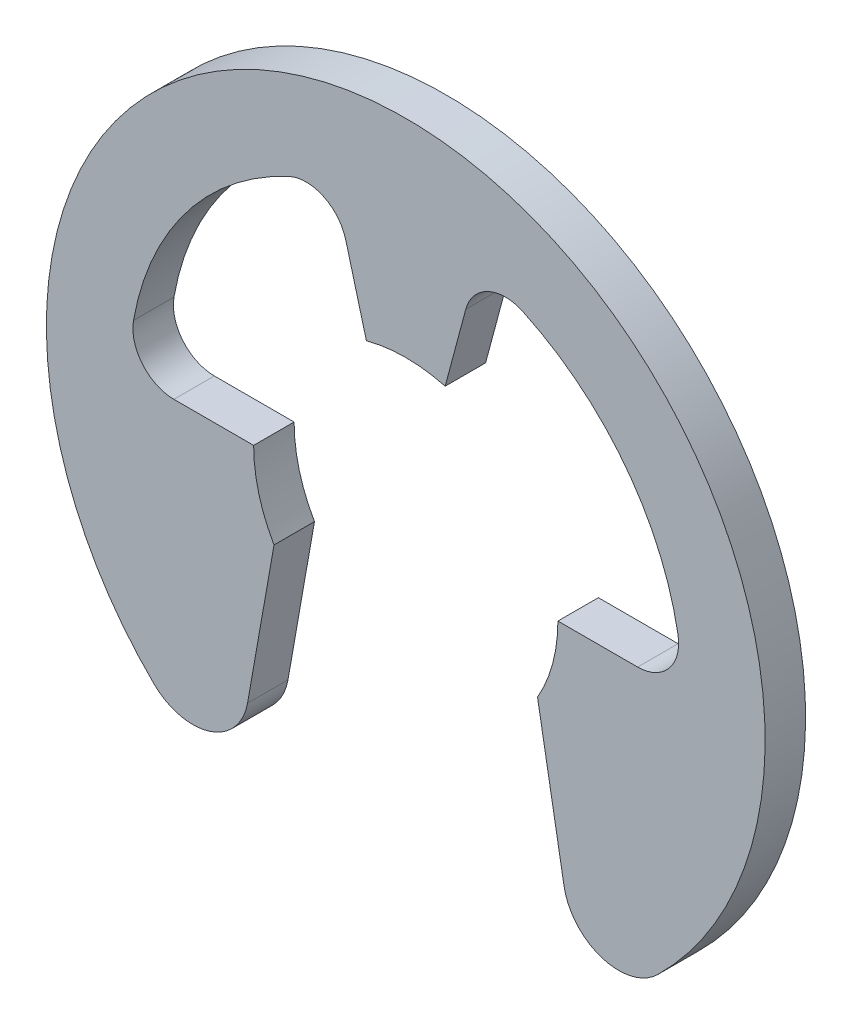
ISO-10303-21;
HEADER;
FILE_DESCRIPTION(('STEP AP214'),'2;1');
FILE_NAME('part.step','',(''),(''),'','','');
FILE_SCHEMA(('AUTOMOTIVE_DESIGN { 1 0 10303 214 1 1 1 1 }'));
ENDSEC;
DATA;
#1=APPLICATION_CONTEXT('core data for automotive mechanical design processes');
#2=APPLICATION_PROTOCOL_DEFINITION('international standard','automotive_design',2000,#1);
#3=PRODUCT_CONTEXT('',#1,'mechanical');
#4=PRODUCT('Part','Part','',(#3));
#5=PRODUCT_RELATED_PRODUCT_CATEGORY('part','',(#4));
#6=PRODUCT_DEFINITION_FORMATION('','',#4);
#7=PRODUCT_DEFINITION_CONTEXT('part definition',#1,'design');
#8=PRODUCT_DEFINITION('design','',#6,#7);
#9=PRODUCT_DEFINITION_SHAPE('','',#8);
#10=(LENGTH_UNIT() NAMED_UNIT(*) SI_UNIT(.MILLI.,.METRE.));
#11=(NAMED_UNIT(*) PLANE_ANGLE_UNIT() SI_UNIT($,.RADIAN.));
#12=(NAMED_UNIT(*) SI_UNIT($,.STERADIAN.) SOLID_ANGLE_UNIT());
#13=UNCERTAINTY_MEASURE_WITH_UNIT(LENGTH_MEASURE(1.E-05),#10,'distance_accuracy_value','');
#14=(GEOMETRIC_REPRESENTATION_CONTEXT(3) GLOBAL_UNCERTAINTY_ASSIGNED_CONTEXT((#13)) GLOBAL_UNIT_ASSIGNED_CONTEXT((#10,
#11,#12)) REPRESENTATION_CONTEXT('',''));
#15=CARTESIAN_POINT('',(0.,0.,0.));
#16=DIRECTION('',(0.,0.,1.));
#17=DIRECTION('',(1.,0.,0.));
#18=AXIS2_PLACEMENT_3D('',#15,#16,#17);
#19=CARTESIAN_POINT('',(3.63847823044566,0.643955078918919,-0.635));
#20=DIRECTION('',(0.,0.,1.));
#21=DIRECTION('',(1.,0.,0.));
#22=AXIS2_PLACEMENT_3D('',#19,#20,#21);
#23=CYLINDRICAL_SURFACE('',#22,0.643955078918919);
#24=CARTESIAN_POINT('',(3.63847823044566,0.643955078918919,0.));
#25=DIRECTION('',(0.,0.,-1.));
#26=DIRECTION('',(1.,0.,0.));
#27=AXIS2_PLACEMENT_3D('',#24,#25,#26);
#28=CIRCLE('',#27,0.643955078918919);
#29=CARTESIAN_POINT('',(4.27257873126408,0.756181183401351,0.));
#30=VERTEX_POINT('',#29);
#31=CARTESIAN_POINT('',(3.63847823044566,0.,0.));
#32=VERTEX_POINT('',#31);
#33=EDGE_CURVE('E190',#30,#32,#28,.T.);
#34=ORIENTED_EDGE('',*,*,#33,.F.);
#35=DIRECTION('',(0.,0.,1.));
#36=VECTOR('',#35,1.);
#37=CARTESIAN_POINT('',(4.27257873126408,0.756181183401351,-0.635));
#38=LINE('',#37,#36);
#39=CARTESIAN_POINT('',(4.27257873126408,0.756181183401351,-0.635));
#40=VERTEX_POINT('',#39);
#41=EDGE_CURVE('E11',#40,#30,#38,.T.);
#42=ORIENTED_EDGE('',*,*,#41,.F.);
#43=CARTESIAN_POINT('',(3.63847823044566,0.643955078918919,-0.635));
#44=DIRECTION('',(0.,0.,-1.));
#45=DIRECTION('',(1.,0.,0.));
#46=AXIS2_PLACEMENT_3D('',#43,#44,#45);
#47=CIRCLE('',#46,0.643955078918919);
#48=CARTESIAN_POINT('',(3.63847823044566,0.,-0.635));
#49=VERTEX_POINT('',#48);
#50=EDGE_CURVE('E240',#40,#49,#47,.T.);
#51=ORIENTED_EDGE('',*,*,#50,.T.);
#52=DIRECTION('',(0.,0.,1.));
#53=VECTOR('',#52,1.);
#54=CARTESIAN_POINT('',(3.63847823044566,0.,-0.635));
#55=LINE('',#54,#53);
#56=EDGE_CURVE('E36',#49,#32,#55,.T.);
#57=ORIENTED_EDGE('',*,*,#56,.T.);
#58=EDGE_LOOP('',(#34,#42,#51,#57));
#59=FACE_BOUND('',#58,.T.);
#60=ADVANCED_FACE('F33',(#59),#23,.F.);
#61=CARTESIAN_POINT('',(0.,0.,-0.635));
#62=DIRECTION('',(0.,0.,1.));
#63=DIRECTION('',(1.,0.,0.));
#64=AXIS2_PLACEMENT_3D('',#61,#62,#63);
#65=CYLINDRICAL_SURFACE('',#64,4.33897902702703);
#66=CARTESIAN_POINT('',(0.,0.,0.));
#67=DIRECTION('',(0.,0.,-1.));
#68=DIRECTION('',(1.,0.,0.));
#69=AXIS2_PLACEMENT_3D('',#66,#67,#68);
#70=CIRCLE('',#69,4.33897902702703);
#71=CARTESIAN_POINT('',(1.83623968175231,3.93128004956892,0.));
#72=VERTEX_POINT('',#71);
#73=EDGE_CURVE('E238',#72,#30,#70,.T.);
#74=ORIENTED_EDGE('',*,*,#73,.F.);
#75=DIRECTION('',(0.,0.,1.));
#76=VECTOR('',#75,1.);
#77=CARTESIAN_POINT('',(1.83623968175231,3.93128004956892,-0.635));
#78=LINE('',#77,#76);
#79=CARTESIAN_POINT('',(1.83623968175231,3.93128004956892,-0.635));
#80=VERTEX_POINT('',#79);
#81=EDGE_CURVE('E42',#80,#72,#78,.T.);
#82=ORIENTED_EDGE('',*,*,#81,.F.);
#83=CARTESIAN_POINT('',(0.,0.,-0.635));
#84=DIRECTION('',(0.,0.,-1.));
#85=DIRECTION('',(1.,0.,0.));
#86=AXIS2_PLACEMENT_3D('',#83,#84,#85);
#87=CIRCLE('',#86,4.33897902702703);
#88=EDGE_CURVE('E180',#80,#40,#87,.T.);
#89=ORIENTED_EDGE('',*,*,#88,.T.);
#90=ORIENTED_EDGE('',*,*,#41,.T.);
#91=EDGE_LOOP('',(#74,#82,#89,#90));
#92=FACE_BOUND('',#91,.T.);
#93=ADVANCED_FACE('F272',(#92),#65,.F.);
#94=CARTESIAN_POINT('',(1.56372030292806,3.34783225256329,-0.635));
#95=DIRECTION('',(0.,0.,1.));
#96=DIRECTION('',(1.,0.,0.));
#97=AXIS2_PLACEMENT_3D('',#94,#95,#96);
#98=CYLINDRICAL_SURFACE('',#97,0.643955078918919);
#99=CARTESIAN_POINT('',(1.56372030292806,3.34783225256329,0.));
#100=DIRECTION('',(0.,0.,-1.));
#101=DIRECTION('',(1.,0.,0.));
#102=AXIS2_PLACEMENT_3D('',#99,#100,#101);
#103=CIRCLE('',#102,0.643955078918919);
#104=CARTESIAN_POINT('',(0.941707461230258,3.51450009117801,0.));
#105=VERTEX_POINT('',#104);
#106=EDGE_CURVE('E167',#105,#72,#103,.T.);
#107=ORIENTED_EDGE('',*,*,#106,.F.);
#108=DIRECTION('',(0.,0.,1.));
#109=VECTOR('',#108,1.);
#110=CARTESIAN_POINT('',(0.941707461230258,3.51450009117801,-0.635));
#111=LINE('',#110,#109);
#112=CARTESIAN_POINT('',(0.941707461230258,3.51450009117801,-0.635));
#113=VERTEX_POINT('',#112);
#114=EDGE_CURVE('E162',#113,#105,#111,.T.);
#115=ORIENTED_EDGE('',*,*,#114,.F.);
#116=CARTESIAN_POINT('',(1.56372030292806,3.34783225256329,-0.635));
#117=DIRECTION('',(0.,0.,-1.));
#118=DIRECTION('',(1.,0.,0.));
#119=AXIS2_PLACEMENT_3D('',#116,#117,#118);
#120=CIRCLE('',#119,0.643955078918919);
#121=EDGE_CURVE('E165',#113,#80,#120,.T.);
#122=ORIENTED_EDGE('',*,*,#121,.T.);
#123=ORIENTED_EDGE('',*,*,#81,.T.);
#124=EDGE_LOOP('',(#107,#115,#122,#123));
#125=FACE_BOUND('',#124,.T.);
#126=ADVANCED_FACE('F164',(#125),#98,.F.);
#127=CARTESIAN_POINT('',(0.617956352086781,2.30624450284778,-0.635));
#128=DIRECTION('',(0.965925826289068,-0.258819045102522,0.));
#129=DIRECTION('',(0.258819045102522,0.965925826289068,0.));
#130=AXIS2_PLACEMENT_3D('',#127,#128,#129);
#131=PLANE('',#130);
#132=DIRECTION('',(0.258819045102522,0.965925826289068,0.));
#133=VECTOR('',#132,1.);
#134=CARTESIAN_POINT('',(0.617956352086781,2.30624450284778,0.));
#135=LINE('',#134,#133);
#136=CARTESIAN_POINT('',(0.617956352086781,2.30624450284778,0.));
#137=VERTEX_POINT('',#136);
#138=EDGE_CURVE('E235',#137,#105,#135,.T.);
#139=ORIENTED_EDGE('',*,*,#138,.F.);
#140=DIRECTION('',(0.,0.,1.));
#141=VECTOR('',#140,1.);
#142=CARTESIAN_POINT('',(0.617956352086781,2.30624450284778,-0.635));
#143=LINE('',#142,#141);
#144=CARTESIAN_POINT('',(0.617956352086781,2.30624450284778,-0.635));
#145=VERTEX_POINT('',#144);
#146=EDGE_CURVE('E172',#145,#137,#143,.T.);
#147=ORIENTED_EDGE('',*,*,#146,.F.);
#148=DIRECTION('',(0.258819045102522,0.965925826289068,0.));
#149=VECTOR('',#148,1.);
#150=CARTESIAN_POINT('',(0.617956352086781,2.30624450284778,-0.635));
#151=LINE('',#150,#149);
#152=EDGE_CURVE('E178',#145,#113,#151,.T.);
#153=ORIENTED_EDGE('',*,*,#152,.T.);
#154=ORIENTED_EDGE('',*,*,#114,.T.);
#155=EDGE_LOOP('',(#139,#147,#153,#154));
#156=FACE_BOUND('',#155,.T.);
#157=ADVANCED_FACE('F182',(#156),#131,.T.);
#158=CARTESIAN_POINT('',(0.,0.,-0.635));
#159=DIRECTION('',(0.,0.,1.));
#160=DIRECTION('',(1.,0.,0.));
#161=AXIS2_PLACEMENT_3D('',#158,#159,#160);
#162=CYLINDRICAL_SURFACE('',#161,2.3876);
#163=CARTESIAN_POINT('',(0.,0.,0.));
#164=DIRECTION('',(0.,0.,-1.));
#165=DIRECTION('',(-1.,0.,0.));
#166=AXIS2_PLACEMENT_3D('',#163,#164,#165);
#167=CIRCLE('',#166,2.3876);
#168=CARTESIAN_POINT('',(-0.61795635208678,2.30624450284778,0.));
#169=VERTEX_POINT('',#168);
#170=EDGE_CURVE('E232',#169,#137,#167,.T.);
#171=ORIENTED_EDGE('',*,*,#170,.F.);
#172=DIRECTION('',(0.,0.,1.));
#173=VECTOR('',#172,1.);
#174=CARTESIAN_POINT('',(-0.61795635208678,2.30624450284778,-0.635));
#175=LINE('',#174,#173);
#176=CARTESIAN_POINT('',(-0.61795635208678,2.30624450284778,-0.635));
#177=VERTEX_POINT('',#176);
#178=EDGE_CURVE('E244',#177,#169,#175,.T.);
#179=ORIENTED_EDGE('',*,*,#178,.F.);
#180=CARTESIAN_POINT('',(0.,0.,-0.635));
#181=DIRECTION('',(0.,0.,-1.));
#182=DIRECTION('',(-1.,0.,0.));
#183=AXIS2_PLACEMENT_3D('',#180,#181,#182);
#184=CIRCLE('',#183,2.3876);
#185=EDGE_CURVE('E183',#177,#145,#184,.T.);
#186=ORIENTED_EDGE('',*,*,#185,.T.);
#187=ORIENTED_EDGE('',*,*,#146,.T.);
#188=EDGE_LOOP('',(#171,#179,#186,#187));
#189=FACE_BOUND('',#188,.T.);
#190=ADVANCED_FACE('F285',(#189),#162,.F.);
#191=CARTESIAN_POINT('',(-0.617956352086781,2.30624450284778,-0.635));
#192=DIRECTION('',(-0.965925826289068,-0.258819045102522,0.));
#193=DIRECTION('',(0.258819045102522,-0.965925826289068,0.));
#194=AXIS2_PLACEMENT_3D('',#191,#192,#193);
#195=PLANE('',#194);
#196=DIRECTION('',(0.258819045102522,-0.965925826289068,0.));
#197=VECTOR('',#196,1.);
#198=CARTESIAN_POINT('',(-0.617956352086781,2.30624450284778,0.));
#199=LINE('',#198,#197);
#200=CARTESIAN_POINT('',(-0.941707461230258,3.51450009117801,0.));
#201=VERTEX_POINT('',#200);
#202=EDGE_CURVE('E229',#201,#169,#199,.T.);
#203=ORIENTED_EDGE('',*,*,#202,.F.);
#204=DIRECTION('',(0.,0.,1.));
#205=VECTOR('',#204,1.);
#206=CARTESIAN_POINT('',(-0.941707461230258,3.51450009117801,-0.635));
#207=LINE('',#206,#205);
#208=CARTESIAN_POINT('',(-0.941707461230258,3.51450009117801,-0.635));
#209=VERTEX_POINT('',#208);
#210=EDGE_CURVE('E246',#209,#201,#207,.T.);
#211=ORIENTED_EDGE('',*,*,#210,.F.);
#212=DIRECTION('',(0.258819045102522,-0.965925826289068,0.));
#213=VECTOR('',#212,1.);
#214=CARTESIAN_POINT('',(-0.617956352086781,2.30624450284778,-0.635));
#215=LINE('',#214,#213);
#216=EDGE_CURVE('E185',#209,#177,#215,.T.);
#217=ORIENTED_EDGE('',*,*,#216,.T.);
#218=ORIENTED_EDGE('',*,*,#178,.T.);
#219=EDGE_LOOP('',(#203,#211,#217,#218));
#220=FACE_BOUND('',#219,.T.);
#221=ADVANCED_FACE('F288',(#220),#195,.T.);
#222=CARTESIAN_POINT('',(-1.56372030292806,3.34783225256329,-0.635));
#223=DIRECTION('',(0.,0.,1.));
#224=DIRECTION('',(1.,0.,0.));
#225=AXIS2_PLACEMENT_3D('',#222,#223,#224);
#226=CYLINDRICAL_SURFACE('',#225,0.643955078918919);
#227=CARTESIAN_POINT('',(-1.56372030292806,3.34783225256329,0.));
#228=DIRECTION('',(0.,0.,-1.));
#229=DIRECTION('',(1.,0.,0.));
#230=AXIS2_PLACEMENT_3D('',#227,#228,#229);
#231=CIRCLE('',#230,0.643955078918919);
#232=CARTESIAN_POINT('',(-1.83623968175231,3.93128004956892,0.));
#233=VERTEX_POINT('',#232);
#234=EDGE_CURVE('E226',#233,#201,#231,.T.);
#235=ORIENTED_EDGE('',*,*,#234,.F.);
#236=DIRECTION('',(0.,0.,1.));
#237=VECTOR('',#236,1.);
#238=CARTESIAN_POINT('',(-1.83623968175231,3.93128004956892,-0.635));
#239=LINE('',#238,#237);
#240=CARTESIAN_POINT('',(-1.83623968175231,3.93128004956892,-0.635));
#241=VERTEX_POINT('',#240);
#242=EDGE_CURVE('E248',#241,#233,#239,.T.);
#243=ORIENTED_EDGE('',*,*,#242,.F.);
#244=CARTESIAN_POINT('',(-1.56372030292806,3.34783225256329,-0.635));
#245=DIRECTION('',(0.,0.,-1.));
#246=DIRECTION('',(1.,0.,0.));
#247=AXIS2_PLACEMENT_3D('',#244,#245,#246);
#248=CIRCLE('',#247,0.643955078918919);
#249=EDGE_CURVE('E496',#241,#209,#248,.T.);
#250=ORIENTED_EDGE('',*,*,#249,.T.);
#251=ORIENTED_EDGE('',*,*,#210,.T.);
#252=EDGE_LOOP('',(#235,#243,#250,#251));
#253=FACE_BOUND('',#252,.T.);
#254=ADVANCED_FACE('F292',(#253),#226,.F.);
#255=CARTESIAN_POINT('',(0.,0.,-0.635));
#256=DIRECTION('',(0.,0.,1.));
#257=DIRECTION('',(1.,0.,0.));
#258=AXIS2_PLACEMENT_3D('',#255,#256,#257);
#259=CYLINDRICAL_SURFACE('',#258,4.33897902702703);
#260=CARTESIAN_POINT('',(0.,0.,0.));
#261=DIRECTION('',(0.,0.,-1.));
#262=DIRECTION('',(1.,0.,0.));
#263=AXIS2_PLACEMENT_3D('',#260,#261,#262);
#264=CIRCLE('',#263,4.33897902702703);
#265=CARTESIAN_POINT('',(-4.27257873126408,0.756181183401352,0.));
#266=VERTEX_POINT('',#265);
#267=EDGE_CURVE('E223',#266,#233,#264,.T.);
#268=ORIENTED_EDGE('',*,*,#267,.F.);
#269=DIRECTION('',(0.,0.,1.));
#270=VECTOR('',#269,1.);
#271=CARTESIAN_POINT('',(-4.27257873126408,0.756181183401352,-0.635));
#272=LINE('',#271,#270);
#273=CARTESIAN_POINT('',(-4.27257873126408,0.756181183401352,-0.635));
#274=VERTEX_POINT('',#273);
#275=EDGE_CURVE('E250',#274,#266,#272,.T.);
#276=ORIENTED_EDGE('',*,*,#275,.F.);
#277=CARTESIAN_POINT('',(0.,0.,-0.635));
#278=DIRECTION('',(0.,0.,-1.));
#279=DIRECTION('',(1.,0.,0.));
#280=AXIS2_PLACEMENT_3D('',#277,#278,#279);
#281=CIRCLE('',#280,4.33897902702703);
#282=EDGE_CURVE('E500',#274,#241,#281,.T.);
#283=ORIENTED_EDGE('',*,*,#282,.T.);
#284=ORIENTED_EDGE('',*,*,#242,.T.);
#285=EDGE_LOOP('',(#268,#276,#283,#284));
#286=FACE_BOUND('',#285,.T.);
#287=ADVANCED_FACE('F296',(#286),#259,.F.);
#288=CARTESIAN_POINT('',(-3.63847823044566,0.643955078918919,-0.635));
#289=DIRECTION('',(0.,0.,1.));
#290=DIRECTION('',(1.,0.,0.));
#291=AXIS2_PLACEMENT_3D('',#288,#289,#290);
#292=CYLINDRICAL_SURFACE('',#291,0.643955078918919);
#293=CARTESIAN_POINT('',(-3.63847823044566,0.643955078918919,0.));
#294=DIRECTION('',(0.,0.,-1.));
#295=DIRECTION('',(1.,0.,0.));
#296=AXIS2_PLACEMENT_3D('',#293,#294,#295);
#297=CIRCLE('',#296,0.643955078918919);
#298=CARTESIAN_POINT('',(-3.63847823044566,0.,0.));
#299=VERTEX_POINT('',#298);
#300=EDGE_CURVE('E220',#299,#266,#297,.T.);
#301=ORIENTED_EDGE('',*,*,#300,.F.);
#302=DIRECTION('',(0.,0.,1.));
#303=VECTOR('',#302,1.);
#304=CARTESIAN_POINT('',(-3.63847823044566,0.,-0.635));
#305=LINE('',#304,#303);
#306=CARTESIAN_POINT('',(-3.63847823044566,0.,-0.635));
#307=VERTEX_POINT('',#306);
#308=EDGE_CURVE('E252',#307,#299,#305,.T.);
#309=ORIENTED_EDGE('',*,*,#308,.F.);
#310=CARTESIAN_POINT('',(-3.63847823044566,0.643955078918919,-0.635));
#311=DIRECTION('',(0.,0.,-1.));
#312=DIRECTION('',(1.,0.,0.));
#313=AXIS2_PLACEMENT_3D('',#310,#311,#312);
#314=CIRCLE('',#313,0.643955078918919);
#315=EDGE_CURVE('E489',#307,#274,#314,.T.);
#316=ORIENTED_EDGE('',*,*,#315,.T.);
#317=ORIENTED_EDGE('',*,*,#275,.T.);
#318=EDGE_LOOP('',(#301,#309,#316,#317));
#319=FACE_BOUND('',#318,.T.);
#320=ADVANCED_FACE('F300',(#319),#292,.F.);
#321=CARTESIAN_POINT('',(-2.3876,0.,-0.635));
#322=DIRECTION('',(0.,1.,0.));
#323=DIRECTION('',(-1.,0.,0.));
#324=AXIS2_PLACEMENT_3D('',#321,#322,#323);
#325=PLANE('',#324);
#326=DIRECTION('',(-1.,0.,0.));
#327=VECTOR('',#326,1.);
#328=CARTESIAN_POINT('',(-2.3876,0.,0.));
#329=LINE('',#328,#327);
#330=CARTESIAN_POINT('',(-2.3876,0.,0.));
#331=VERTEX_POINT('',#330);
#332=EDGE_CURVE('E217',#331,#299,#329,.T.);
#333=ORIENTED_EDGE('',*,*,#332,.F.);
#334=DIRECTION('',(0.,0.,1.));
#335=VECTOR('',#334,1.);
#336=CARTESIAN_POINT('',(-2.3876,0.,-0.635));
#337=LINE('',#336,#335);
#338=CARTESIAN_POINT('',(-2.3876,0.,-0.635));
#339=VERTEX_POINT('',#338);
#340=EDGE_CURVE('E254',#339,#331,#337,.T.);
#341=ORIENTED_EDGE('',*,*,#340,.F.);
#342=DIRECTION('',(-1.,0.,0.));
#343=VECTOR('',#342,1.);
#344=CARTESIAN_POINT('',(-2.3876,0.,-0.635));
#345=LINE('',#344,#343);
#346=EDGE_CURVE('E485',#339,#307,#345,.T.);
#347=ORIENTED_EDGE('',*,*,#346,.T.);
#348=ORIENTED_EDGE('',*,*,#308,.T.);
#349=EDGE_LOOP('',(#333,#341,#347,#348));
#350=FACE_BOUND('',#349,.T.);
#351=ADVANCED_FACE('F304',(#350),#325,.T.);
#352=CARTESIAN_POINT('',(0.,0.,-0.635));
#353=DIRECTION('',(0.,0.,1.));
#354=DIRECTION('',(1.,0.,0.));
#355=AXIS2_PLACEMENT_3D('',#352,#353,#354);
#356=CYLINDRICAL_SURFACE('',#355,2.3876);
#357=CARTESIAN_POINT('',(0.,0.,0.));
#358=DIRECTION('',(0.,0.,-1.));
#359=DIRECTION('',(1.,0.,0.));
#360=AXIS2_PLACEMENT_3D('',#357,#358,#359);
#361=CIRCLE('',#360,2.3876);
#362=CARTESIAN_POINT('',(-2.06772225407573,-1.1938,0.));
#363=VERTEX_POINT('',#362);
#364=EDGE_CURVE('E214',#363,#331,#361,.T.);
#365=ORIENTED_EDGE('',*,*,#364,.F.);
#366=DIRECTION('',(0.,0.,1.));
#367=VECTOR('',#366,1.);
#368=CARTESIAN_POINT('',(-2.06772225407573,-1.1938,-0.635));
#369=LINE('',#368,#367);
#370=CARTESIAN_POINT('',(-2.06772225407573,-1.1938,-0.635));
#371=VERTEX_POINT('',#370);
#372=EDGE_CURVE('E256',#371,#363,#369,.T.);
#373=ORIENTED_EDGE('',*,*,#372,.F.);
#374=CARTESIAN_POINT('',(0.,0.,-0.635));
#375=DIRECTION('',(0.,0.,-1.));
#376=DIRECTION('',(1.,0.,0.));
#377=AXIS2_PLACEMENT_3D('',#374,#375,#376);
#378=CIRCLE('',#377,2.3876);
#379=EDGE_CURVE('E506',#371,#339,#378,.T.);
#380=ORIENTED_EDGE('',*,*,#379,.T.);
#381=ORIENTED_EDGE('',*,*,#340,.T.);
#382=EDGE_LOOP('',(#365,#373,#380,#381));
#383=FACE_BOUND('',#382,.T.);
#384=ADVANCED_FACE('F308',(#383),#356,.F.);
#385=CARTESIAN_POINT('',(-2.06772225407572,-1.1938,-0.635));
#386=DIRECTION('',(0.984807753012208,-0.17364817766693,0.));
#387=DIRECTION('',(0.17364817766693,0.984807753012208,0.));
#388=AXIS2_PLACEMENT_3D('',#385,#386,#387);
#389=PLANE('',#388);
#390=DIRECTION('',(0.17364817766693,0.984807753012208,0.));
#391=VECTOR('',#390,1.);
#392=CARTESIAN_POINT('',(-2.06772225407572,-1.1938,0.));
#393=LINE('',#392,#391);
#394=CARTESIAN_POINT('',(-2.48361962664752,-3.55247120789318,0.));
#395=VERTEX_POINT('',#394);
#396=EDGE_CURVE('E211',#395,#363,#393,.T.);
#397=ORIENTED_EDGE('',*,*,#396,.F.);
#398=DIRECTION('',(0.,0.,1.));
#399=VECTOR('',#398,1.);
#400=CARTESIAN_POINT('',(-2.48361962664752,-3.55247120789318,-0.635));
#401=LINE('',#400,#399);
#402=CARTESIAN_POINT('',(-2.48361962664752,-3.55247120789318,-0.635));
#403=VERTEX_POINT('',#402);
#404=EDGE_CURVE('E258',#403,#395,#401,.T.);
#405=ORIENTED_EDGE('',*,*,#404,.F.);
#406=DIRECTION('',(0.17364817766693,0.984807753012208,0.));
#407=VECTOR('',#406,1.);
#408=CARTESIAN_POINT('',(-2.06772225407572,-1.1938,-0.635));
#409=LINE('',#408,#407);
#410=EDGE_CURVE('E478',#403,#371,#409,.T.);
#411=ORIENTED_EDGE('',*,*,#410,.T.);
#412=ORIENTED_EDGE('',*,*,#372,.T.);
#413=EDGE_LOOP('',(#397,#405,#411,#412));
#414=FACE_BOUND('',#413,.T.);
#415=ADVANCED_FACE('F312',(#414),#389,.T.);
#416=CARTESIAN_POINT('',(-3.34199378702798,-3.40111668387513,-0.635));
#417=DIRECTION('',(0.,0.,1.));
#418=DIRECTION('',(1.,0.,0.));
#419=AXIS2_PLACEMENT_3D('',#416,#417,#418);
#420=CYLINDRICAL_SURFACE('',#419,0.871615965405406);
#421=CARTESIAN_POINT('',(-3.34199378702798,-3.40111668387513,0.));
#422=DIRECTION('',(0.,0.,1.));
#423=DIRECTION('',(1.,0.,0.));
#424=AXIS2_PLACEMENT_3D('',#421,#422,#423);
#425=CIRCLE('',#424,0.871615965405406);
#426=CARTESIAN_POINT('',(-3.95289198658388,-4.02282222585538,0.));
#427=VERTEX_POINT('',#426);
#428=EDGE_CURVE('E208',#427,#395,#425,.T.);
#429=ORIENTED_EDGE('',*,*,#428,.F.);
#430=DIRECTION('',(0.,0.,1.));
#431=VECTOR('',#430,1.);
#432=CARTESIAN_POINT('',(-3.95289198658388,-4.02282222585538,-0.635));
#433=LINE('',#432,#431);
#434=CARTESIAN_POINT('',(-3.95289198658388,-4.02282222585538,-0.635));
#435=VERTEX_POINT('',#434);
#436=EDGE_CURVE('E260',#435,#427,#433,.T.);
#437=ORIENTED_EDGE('',*,*,#436,.F.);
#438=CARTESIAN_POINT('',(-3.34199378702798,-3.40111668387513,-0.635));
#439=DIRECTION('',(0.,0.,1.));
#440=DIRECTION('',(1.,0.,0.));
#441=AXIS2_PLACEMENT_3D('',#438,#439,#440);
#442=CIRCLE('',#441,0.871615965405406);
#443=EDGE_CURVE('E474',#435,#403,#442,.T.);
#444=ORIENTED_EDGE('',*,*,#443,.T.);
#445=ORIENTED_EDGE('',*,*,#404,.T.);
#446=EDGE_LOOP('',(#429,#437,#444,#445));
#447=FACE_BOUND('',#446,.T.);
#448=ADVANCED_FACE('F316',(#447),#420,.T.);
#449=CARTESIAN_POINT('',(0.,0.,-0.635));
#450=DIRECTION('',(0.,0.,1.));
#451=DIRECTION('',(1.,0.,0.));
#452=AXIS2_PLACEMENT_3D('',#449,#450,#451);
#453=CYLINDRICAL_SURFACE('',#452,5.63989837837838);
#454=CARTESIAN_POINT('',(0.,0.,0.));
#455=DIRECTION('',(0.,0.,1.));
#456=DIRECTION('',(1.,0.,0.));
#457=AXIS2_PLACEMENT_3D('',#454,#455,#456);
#458=CIRCLE('',#457,5.63989837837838);
#459=CARTESIAN_POINT('',(3.95289198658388,-4.02282222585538,0.));
#460=VERTEX_POINT('',#459);
#461=EDGE_CURVE('E205',#460,#427,#458,.T.);
#462=ORIENTED_EDGE('',*,*,#461,.F.);
#463=DIRECTION('',(0.,0.,1.));
#464=VECTOR('',#463,1.);
#465=CARTESIAN_POINT('',(3.95289198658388,-4.02282222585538,-0.635));
#466=LINE('',#465,#464);
#467=CARTESIAN_POINT('',(3.95289198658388,-4.02282222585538,-0.635));
#468=VERTEX_POINT('',#467);
#469=EDGE_CURVE('E262',#468,#460,#466,.T.);
#470=ORIENTED_EDGE('',*,*,#469,.F.);
#471=CARTESIAN_POINT('',(0.,0.,-0.635));
#472=DIRECTION('',(0.,0.,1.));
#473=DIRECTION('',(1.,0.,0.));
#474=AXIS2_PLACEMENT_3D('',#471,#472,#473);
#475=CIRCLE('',#474,5.63989837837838);
#476=EDGE_CURVE('E510',#468,#435,#475,.T.);
#477=ORIENTED_EDGE('',*,*,#476,.T.);
#478=ORIENTED_EDGE('',*,*,#436,.T.);
#479=EDGE_LOOP('',(#462,#470,#477,#478));
#480=FACE_BOUND('',#479,.T.);
#481=ADVANCED_FACE('F320',(#480),#453,.T.);
#482=CARTESIAN_POINT('',(3.34199378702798,-3.40111668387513,-0.635));
#483=DIRECTION('',(0.,0.,1.));
#484=DIRECTION('',(1.,0.,0.));
#485=AXIS2_PLACEMENT_3D('',#482,#483,#484);
#486=CYLINDRICAL_SURFACE('',#485,0.871615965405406);
#487=CARTESIAN_POINT('',(3.34199378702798,-3.40111668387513,0.));
#488=DIRECTION('',(0.,0.,1.));
#489=DIRECTION('',(1.,0.,0.));
#490=AXIS2_PLACEMENT_3D('',#487,#488,#489);
#491=CIRCLE('',#490,0.871615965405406);
#492=CARTESIAN_POINT('',(2.48361962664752,-3.55247120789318,0.));
#493=VERTEX_POINT('',#492);
#494=EDGE_CURVE('E202',#493,#460,#491,.T.);
#495=ORIENTED_EDGE('',*,*,#494,.F.);
#496=DIRECTION('',(0.,0.,1.));
#497=VECTOR('',#496,1.);
#498=CARTESIAN_POINT('',(2.48361962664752,-3.55247120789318,-0.635));
#499=LINE('',#498,#497);
#500=CARTESIAN_POINT('',(2.48361962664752,-3.55247120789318,-0.635));
#501=VERTEX_POINT('',#500);
#502=EDGE_CURVE('E264',#501,#493,#499,.T.);
#503=ORIENTED_EDGE('',*,*,#502,.F.);
#504=CARTESIAN_POINT('',(3.34199378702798,-3.40111668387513,-0.635));
#505=DIRECTION('',(0.,0.,1.));
#506=DIRECTION('',(1.,0.,0.));
#507=AXIS2_PLACEMENT_3D('',#504,#505,#506);
#508=CIRCLE('',#507,0.871615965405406);
#509=EDGE_CURVE('E467',#501,#468,#508,.T.);
#510=ORIENTED_EDGE('',*,*,#509,.T.);
#511=ORIENTED_EDGE('',*,*,#469,.T.);
#512=EDGE_LOOP('',(#495,#503,#510,#511));
#513=FACE_BOUND('',#512,.T.);
#514=ADVANCED_FACE('F324',(#513),#486,.T.);
#515=CARTESIAN_POINT('',(2.06772225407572,-1.1938,-0.635));
#516=DIRECTION('',(-0.984807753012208,-0.17364817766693,0.));
#517=DIRECTION('',(0.17364817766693,-0.984807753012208,0.));
#518=AXIS2_PLACEMENT_3D('',#515,#516,#517);
#519=PLANE('',#518);
#520=DIRECTION('',(0.17364817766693,-0.984807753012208,0.));
#521=VECTOR('',#520,1.);
#522=CARTESIAN_POINT('',(2.06772225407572,-1.1938,0.));
#523=LINE('',#522,#521);
#524=CARTESIAN_POINT('',(2.06772225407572,-1.1938,0.));
#525=VERTEX_POINT('',#524);
#526=EDGE_CURVE('E199',#525,#493,#523,.T.);
#527=ORIENTED_EDGE('',*,*,#526,.F.);
#528=DIRECTION('',(0.,0.,1.));
#529=VECTOR('',#528,1.);
#530=CARTESIAN_POINT('',(2.06772225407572,-1.1938,-0.635));
#531=LINE('',#530,#529);
#532=CARTESIAN_POINT('',(2.06772225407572,-1.1938,-0.635));
#533=VERTEX_POINT('',#532);
#534=EDGE_CURVE('E266',#533,#525,#531,.T.);
#535=ORIENTED_EDGE('',*,*,#534,.F.);
#536=DIRECTION('',(0.17364817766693,-0.984807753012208,0.));
#537=VECTOR('',#536,1.);
#538=CARTESIAN_POINT('',(2.06772225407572,-1.1938,-0.635));
#539=LINE('',#538,#537);
#540=EDGE_CURVE('E463',#533,#501,#539,.T.);
#541=ORIENTED_EDGE('',*,*,#540,.T.);
#542=ORIENTED_EDGE('',*,*,#502,.T.);
#543=EDGE_LOOP('',(#527,#535,#541,#542));
#544=FACE_BOUND('',#543,.T.);
#545=ADVANCED_FACE('F328',(#544),#519,.T.);
#546=CARTESIAN_POINT('',(0.,0.,-0.635));
#547=DIRECTION('',(0.,0.,1.));
#548=DIRECTION('',(1.,0.,0.));
#549=AXIS2_PLACEMENT_3D('',#546,#547,#548);
#550=CYLINDRICAL_SURFACE('',#549,2.3876);
#551=CARTESIAN_POINT('',(0.,0.,0.));
#552=DIRECTION('',(0.,0.,-1.));
#553=DIRECTION('',(1.,0.,0.));
#554=AXIS2_PLACEMENT_3D('',#551,#552,#553);
#555=CIRCLE('',#554,2.3876);
#556=CARTESIAN_POINT('',(2.3876,0.,0.));
#557=VERTEX_POINT('',#556);
#558=EDGE_CURVE('E196',#557,#525,#555,.T.);
#559=ORIENTED_EDGE('',*,*,#558,.F.);
#560=DIRECTION('',(0.,0.,1.));
#561=VECTOR('',#560,1.);
#562=CARTESIAN_POINT('',(2.3876,0.,-0.635));
#563=LINE('',#562,#561);
#564=CARTESIAN_POINT('',(2.3876,0.,-0.635));
#565=VERTEX_POINT('',#564);
#566=EDGE_CURVE('E267',#565,#557,#563,.T.);
#567=ORIENTED_EDGE('',*,*,#566,.F.);
#568=CARTESIAN_POINT('',(0.,0.,-0.635));
#569=DIRECTION('',(0.,0.,-1.));
#570=DIRECTION('',(1.,0.,0.));
#571=AXIS2_PLACEMENT_3D('',#568,#569,#570);
#572=CIRCLE('',#571,2.3876);
#573=EDGE_CURVE('E514',#565,#533,#572,.T.);
#574=ORIENTED_EDGE('',*,*,#573,.T.);
#575=ORIENTED_EDGE('',*,*,#534,.T.);
#576=EDGE_LOOP('',(#559,#567,#574,#575));
#577=FACE_BOUND('',#576,.T.);
#578=ADVANCED_FACE('F332',(#577),#550,.F.);
#579=CARTESIAN_POINT('',(2.3876,0.,-0.635));
#580=DIRECTION('',(0.,1.,0.));
#581=DIRECTION('',(0.,0.,1.));
#582=AXIS2_PLACEMENT_3D('',#579,#580,#581);
#583=PLANE('',#582);
#584=DIRECTION('',(-1.,0.,0.));
#585=VECTOR('',#584,1.);
#586=CARTESIAN_POINT('',(2.3876,0.,0.));
#587=LINE('',#586,#585);
#588=EDGE_CURVE('E193',#32,#557,#587,.T.);
#589=ORIENTED_EDGE('',*,*,#588,.F.);
#590=ORIENTED_EDGE('',*,*,#56,.F.);
#591=DIRECTION('',(-1.,0.,0.));
#592=VECTOR('',#591,1.);
#593=CARTESIAN_POINT('',(2.3876,0.,-0.635));
#594=LINE('',#593,#592);
#595=EDGE_CURVE('E516',#49,#565,#594,.T.);
#596=ORIENTED_EDGE('',*,*,#595,.T.);
#597=ORIENTED_EDGE('',*,*,#566,.T.);
#598=EDGE_LOOP('',(#589,#590,#596,#597));
#599=FACE_BOUND('',#598,.T.);
#600=ADVANCED_FACE('F269',(#599),#583,.T.);
#601=CARTESIAN_POINT('',(3.63847823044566,0.643955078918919,-0.635));
#602=DIRECTION('',(0.,0.,1.));
#603=DIRECTION('',(1.,0.,0.));
#604=AXIS2_PLACEMENT_3D('',#601,#602,#603);
#605=PLANE('',#604);
#606=ORIENTED_EDGE('',*,*,#50,.F.);
#607=ORIENTED_EDGE('',*,*,#88,.F.);
#608=ORIENTED_EDGE('',*,*,#121,.F.);
#609=ORIENTED_EDGE('',*,*,#152,.F.);
#610=ORIENTED_EDGE('',*,*,#185,.F.);
#611=ORIENTED_EDGE('',*,*,#216,.F.);
#612=ORIENTED_EDGE('',*,*,#249,.F.);
#613=ORIENTED_EDGE('',*,*,#282,.F.);
#614=ORIENTED_EDGE('',*,*,#315,.F.);
#615=ORIENTED_EDGE('',*,*,#346,.F.);
#616=ORIENTED_EDGE('',*,*,#379,.F.);
#617=ORIENTED_EDGE('',*,*,#410,.F.);
#618=ORIENTED_EDGE('',*,*,#443,.F.);
#619=ORIENTED_EDGE('',*,*,#476,.F.);
#620=ORIENTED_EDGE('',*,*,#509,.F.);
#621=ORIENTED_EDGE('',*,*,#540,.F.);
#622=ORIENTED_EDGE('',*,*,#573,.F.);
#623=ORIENTED_EDGE('',*,*,#595,.F.);
#624=EDGE_LOOP('',(#606,#607,#608,#609,#610,#611,#612,#613,#614,#615,#616,#617,#618,#619,#620,
#621,#622,#623));
#625=FACE_BOUND('',#624,.T.);
#626=ADVANCED_FACE('F176',(#625),#605,.F.);
#627=CARTESIAN_POINT('',(3.63847823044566,0.643955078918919,0.));
#628=DIRECTION('',(0.,0.,1.));
#629=DIRECTION('',(1.,0.,0.));
#630=AXIS2_PLACEMENT_3D('',#627,#628,#629);
#631=PLANE('',#630);
#632=ORIENTED_EDGE('',*,*,#33,.T.);
#633=ORIENTED_EDGE('',*,*,#588,.T.);
#634=ORIENTED_EDGE('',*,*,#558,.T.);
#635=ORIENTED_EDGE('',*,*,#526,.T.);
#636=ORIENTED_EDGE('',*,*,#494,.T.);
#637=ORIENTED_EDGE('',*,*,#461,.T.);
#638=ORIENTED_EDGE('',*,*,#428,.T.);
#639=ORIENTED_EDGE('',*,*,#396,.T.);
#640=ORIENTED_EDGE('',*,*,#364,.T.);
#641=ORIENTED_EDGE('',*,*,#332,.T.);
#642=ORIENTED_EDGE('',*,*,#300,.T.);
#643=ORIENTED_EDGE('',*,*,#267,.T.);
#644=ORIENTED_EDGE('',*,*,#234,.T.);
#645=ORIENTED_EDGE('',*,*,#202,.T.);
#646=ORIENTED_EDGE('',*,*,#170,.T.);
#647=ORIENTED_EDGE('',*,*,#138,.T.);
#648=ORIENTED_EDGE('',*,*,#106,.T.);
#649=ORIENTED_EDGE('',*,*,#73,.T.);
#650=EDGE_LOOP('',(#632,#633,#634,#635,#636,#637,#638,#639,#640,#641,#642,#643,#644,#645,#646,
#647,#648,#649));
#651=FACE_BOUND('',#650,.T.);
#652=ADVANCED_FACE('F271',(#651),#631,.T.);
#653=CLOSED_SHELL('',(#60,#93,#126,#157,#190,#221,#254,#287,#320,#351,#384,#415,#448,#481,#514,
#545,#578,#600,#626,#652));
#654=MANIFOLD_SOLID_BREP('B2',#653);
#655=ADVANCED_BREP_SHAPE_REPRESENTATION('',(#18,#654),#14);
#656=SHAPE_DEFINITION_REPRESENTATION(#9,#655);
ENDSEC;
END-ISO-10303-21;
